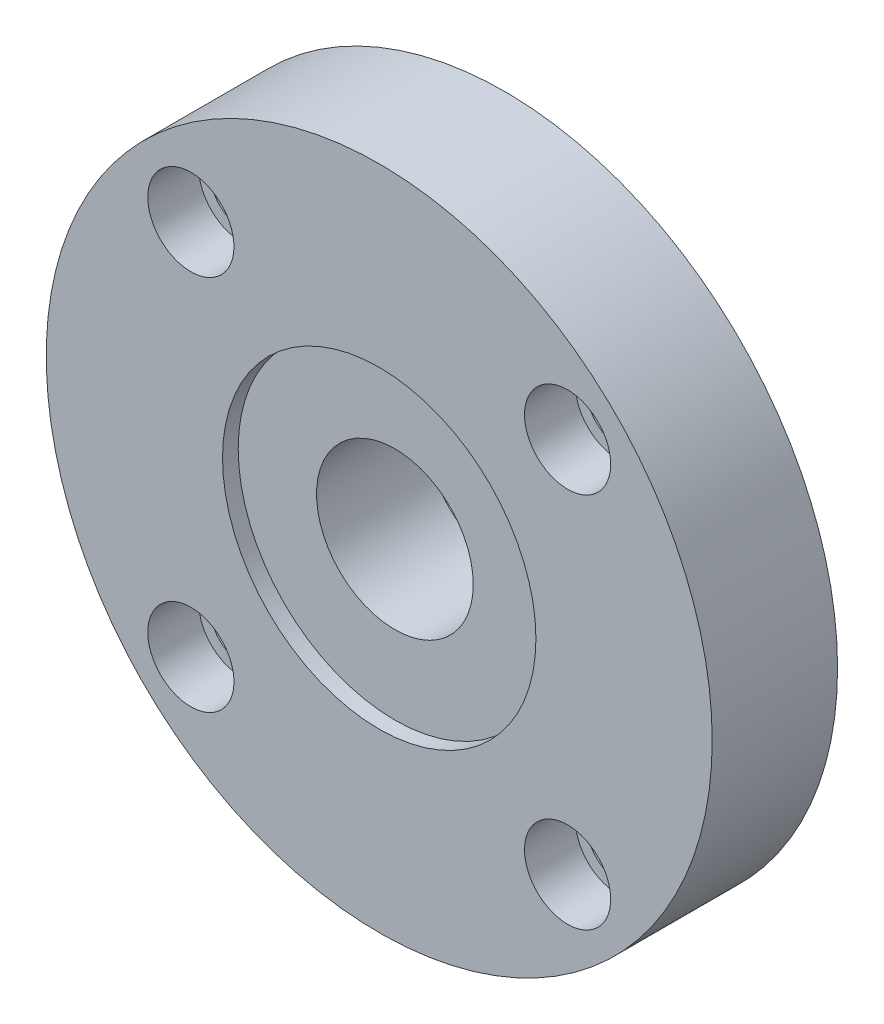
ISO-10303-21;
HEADER;
FILE_DESCRIPTION(('STEP AP214'),'2;1');
FILE_NAME('part.step','',(''),(''),'','','');
FILE_SCHEMA(('AUTOMOTIVE_DESIGN { 1 0 10303 214 1 1 1 1 }'));
ENDSEC;
DATA;
#1=APPLICATION_CONTEXT('core data for automotive mechanical design processes');
#2=APPLICATION_PROTOCOL_DEFINITION('international standard','automotive_design',2000,#1);
#3=PRODUCT_CONTEXT('',#1,'mechanical');
#4=PRODUCT('Part','Part','',(#3));
#5=PRODUCT_RELATED_PRODUCT_CATEGORY('part','',(#4));
#6=PRODUCT_DEFINITION_FORMATION('','',#4);
#7=PRODUCT_DEFINITION_CONTEXT('part definition',#1,'design');
#8=PRODUCT_DEFINITION('design','',#6,#7);
#9=PRODUCT_DEFINITION_SHAPE('','',#8);
#10=(LENGTH_UNIT() NAMED_UNIT(*) SI_UNIT(.MILLI.,.METRE.));
#11=(NAMED_UNIT(*) PLANE_ANGLE_UNIT() SI_UNIT($,.RADIAN.));
#12=(NAMED_UNIT(*) SI_UNIT($,.STERADIAN.) SOLID_ANGLE_UNIT());
#13=UNCERTAINTY_MEASURE_WITH_UNIT(LENGTH_MEASURE(1.E-05),#10,'distance_accuracy_value','');
#14=(GEOMETRIC_REPRESENTATION_CONTEXT(3) GLOBAL_UNCERTAINTY_ASSIGNED_CONTEXT((#13)) GLOBAL_UNIT_ASSIGNED_CONTEXT((#10,
#11,#12)) REPRESENTATION_CONTEXT('',''));
#15=CARTESIAN_POINT('',(0.,0.,0.));
#16=DIRECTION('',(0.,0.,1.));
#17=DIRECTION('',(1.,0.,0.));
#18=AXIS2_PLACEMENT_3D('',#15,#16,#17);
#19=CARTESIAN_POINT('',(0.,0.,16.));
#20=DIRECTION('',(0.,0.,-1.));
#21=DIRECTION('',(-1.,0.,0.));
#22=AXIS2_PLACEMENT_3D('',#19,#20,#21);
#23=CYLINDRICAL_SURFACE('',#22,10.);
#24=CARTESIAN_POINT('',(0.,0.,0.));
#25=DIRECTION('',(0.,0.,1.));
#26=DIRECTION('',(1.,0.,0.));
#27=AXIS2_PLACEMENT_3D('',#24,#25,#26);
#28=CIRCLE('',#27,10.);
#29=CARTESIAN_POINT('',(10.,0.,0.));
#30=VERTEX_POINT('',#29);
#31=EDGE_CURVE('E25',#30,#30,#28,.T.);
#32=ORIENTED_EDGE('',*,*,#31,.F.);
#33=EDGE_LOOP('',(#32));
#34=FACE_BOUND('',#33,.T.);
#35=CARTESIAN_POINT('',(0.,0.,14.));
#36=DIRECTION('',(0.,0.,1.));
#37=DIRECTION('',(1.,0.,0.));
#38=AXIS2_PLACEMENT_3D('',#35,#36,#37);
#39=CIRCLE('',#38,10.);
#40=CARTESIAN_POINT('',(10.,0.,14.));
#41=VERTEX_POINT('',#40);
#42=EDGE_CURVE('E16',#41,#41,#39,.T.);
#43=ORIENTED_EDGE('',*,*,#42,.T.);
#44=EDGE_LOOP('',(#43));
#45=FACE_BOUND('',#44,.T.);
#46=ADVANCED_FACE('F12',(#34,#45),#23,.F.);
#47=CARTESIAN_POINT('',(-24.0416305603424,24.0416305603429,0.));
#48=DIRECTION('',(0.,0.,1.));
#49=DIRECTION('',(1.,0.,0.));
#50=AXIS2_PLACEMENT_3D('',#47,#48,#49);
#51=CYLINDRICAL_SURFACE('',#50,4.);
#52=CARTESIAN_POINT('',(-24.0416305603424,24.0416305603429,0.));
#53=DIRECTION('',(0.,0.,1.));
#54=DIRECTION('',(0.,1.,0.));
#55=AXIS2_PLACEMENT_3D('',#52,#53,#54);
#56=CIRCLE('',#55,4.);
#57=CARTESIAN_POINT('',(-24.0416305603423,28.0416305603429,0.));
#58=VERTEX_POINT('',#57);
#59=EDGE_CURVE('E37',#58,#58,#56,.T.);
#60=ORIENTED_EDGE('',*,*,#59,.F.);
#61=EDGE_LOOP('',(#60));
#62=FACE_BOUND('',#61,.T.);
#63=CARTESIAN_POINT('',(-24.0416305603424,24.0416305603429,9.5));
#64=DIRECTION('',(0.,0.,1.));
#65=DIRECTION('',(1.,0.,0.));
#66=AXIS2_PLACEMENT_3D('',#63,#64,#65);
#67=CIRCLE('',#66,4.);
#68=CARTESIAN_POINT('',(-20.0416305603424,24.0416305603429,9.5));
#69=VERTEX_POINT('',#68);
#70=EDGE_CURVE('E43',#69,#69,#67,.F.);
#71=ORIENTED_EDGE('',*,*,#70,.F.);
#72=EDGE_LOOP('',(#71));
#73=FACE_BOUND('',#72,.T.);
#74=ADVANCED_FACE('F87',(#62,#73),#51,.F.);
#75=CARTESIAN_POINT('',(-24.0416305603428,-24.0416305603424,0.));
#76=DIRECTION('',(0.,0.,1.));
#77=DIRECTION('',(1.,0.,0.));
#78=AXIS2_PLACEMENT_3D('',#75,#76,#77);
#79=CYLINDRICAL_SURFACE('',#78,4.);
#80=CARTESIAN_POINT('',(-24.0416305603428,-24.0416305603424,0.));
#81=DIRECTION('',(0.,0.,1.));
#82=DIRECTION('',(-1.,0.,0.));
#83=AXIS2_PLACEMENT_3D('',#80,#81,#82);
#84=CIRCLE('',#83,4.);
#85=CARTESIAN_POINT('',(-28.0416305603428,-24.0416305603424,0.));
#86=VERTEX_POINT('',#85);
#87=EDGE_CURVE('E68',#86,#86,#84,.T.);
#88=ORIENTED_EDGE('',*,*,#87,.F.);
#89=EDGE_LOOP('',(#88));
#90=FACE_BOUND('',#89,.T.);
#91=CARTESIAN_POINT('',(-24.0416305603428,-24.0416305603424,9.5));
#92=DIRECTION('',(0.,0.,1.));
#93=DIRECTION('',(1.,0.,0.));
#94=AXIS2_PLACEMENT_3D('',#91,#92,#93);
#95=CIRCLE('',#94,4.);
#96=CARTESIAN_POINT('',(-20.0416305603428,-24.0416305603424,9.5));
#97=VERTEX_POINT('',#96);
#98=EDGE_CURVE('E39',#97,#97,#95,.F.);
#99=ORIENTED_EDGE('',*,*,#98,.F.);
#100=EDGE_LOOP('',(#99));
#101=FACE_BOUND('',#100,.T.);
#102=ADVANCED_FACE('F160',(#90,#101),#79,.F.);
#103=CARTESIAN_POINT('',(24.0416305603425,-24.0416305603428,0.));
#104=DIRECTION('',(0.,0.,1.));
#105=DIRECTION('',(1.,0.,0.));
#106=AXIS2_PLACEMENT_3D('',#103,#104,#105);
#107=CYLINDRICAL_SURFACE('',#106,4.);
#108=CARTESIAN_POINT('',(24.0416305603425,-24.0416305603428,0.));
#109=DIRECTION('',(0.,0.,1.));
#110=DIRECTION('',(0.,-1.,0.));
#111=AXIS2_PLACEMENT_3D('',#108,#109,#110);
#112=CIRCLE('',#111,4.);
#113=CARTESIAN_POINT('',(24.0416305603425,-28.0416305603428,0.));
#114=VERTEX_POINT('',#113);
#115=EDGE_CURVE('E71',#114,#114,#112,.T.);
#116=ORIENTED_EDGE('',*,*,#115,.F.);
#117=EDGE_LOOP('',(#116));
#118=FACE_BOUND('',#117,.T.);
#119=CARTESIAN_POINT('',(24.0416305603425,-24.0416305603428,9.5));
#120=DIRECTION('',(0.,0.,1.));
#121=DIRECTION('',(1.,0.,0.));
#122=AXIS2_PLACEMENT_3D('',#119,#120,#121);
#123=CIRCLE('',#122,4.);
#124=CARTESIAN_POINT('',(28.0416305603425,-24.0416305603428,9.5));
#125=VERTEX_POINT('',#124);
#126=EDGE_CURVE('E34',#125,#125,#123,.F.);
#127=ORIENTED_EDGE('',*,*,#126,.F.);
#128=EDGE_LOOP('',(#127));
#129=FACE_BOUND('',#128,.T.);
#130=ADVANCED_FACE('F135',(#118,#129),#107,.F.);
#131=CARTESIAN_POINT('',(24.0416305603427,24.0416305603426,0.));
#132=DIRECTION('',(0.,0.,1.));
#133=DIRECTION('',(1.,0.,0.));
#134=AXIS2_PLACEMENT_3D('',#131,#132,#133);
#135=CYLINDRICAL_SURFACE('',#134,4.);
#136=CARTESIAN_POINT('',(24.0416305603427,24.0416305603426,0.));
#137=DIRECTION('',(0.,0.,1.));
#138=DIRECTION('',(1.,0.,0.));
#139=AXIS2_PLACEMENT_3D('',#136,#137,#138);
#140=CIRCLE('',#139,4.);
#141=CARTESIAN_POINT('',(28.0416305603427,24.0416305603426,0.));
#142=VERTEX_POINT('',#141);
#143=EDGE_CURVE('E32',#142,#142,#140,.T.);
#144=ORIENTED_EDGE('',*,*,#143,.F.);
#145=EDGE_LOOP('',(#144));
#146=FACE_BOUND('',#145,.T.);
#147=CARTESIAN_POINT('',(24.0416305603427,24.0416305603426,9.5));
#148=DIRECTION('',(0.,0.,1.));
#149=DIRECTION('',(1.,0.,0.));
#150=AXIS2_PLACEMENT_3D('',#147,#148,#149);
#151=CIRCLE('',#150,4.);
#152=CARTESIAN_POINT('',(28.0416305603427,24.0416305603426,9.5));
#153=VERTEX_POINT('',#152);
#154=EDGE_CURVE('E29',#153,#153,#151,.F.);
#155=ORIENTED_EDGE('',*,*,#154,.F.);
#156=EDGE_LOOP('',(#155));
#157=FACE_BOUND('',#156,.T.);
#158=ADVANCED_FACE('F106',(#146,#157),#135,.F.);
#159=CARTESIAN_POINT('',(0.,0.,16.));
#160=DIRECTION('',(0.,0.,1.));
#161=DIRECTION('',(1.,0.,0.));
#162=AXIS2_PLACEMENT_3D('',#159,#160,#161);
#163=PLANE('',#162);
#164=CARTESIAN_POINT('',(0.,0.,16.));
#165=DIRECTION('',(0.,0.,1.));
#166=DIRECTION('',(1.,0.,0.));
#167=AXIS2_PLACEMENT_3D('',#164,#165,#166);
#168=CIRCLE('',#167,20.);
#169=CARTESIAN_POINT('',(20.,0.,16.));
#170=VERTEX_POINT('',#169);
#171=EDGE_CURVE('E94',#170,#170,#168,.T.);
#172=ORIENTED_EDGE('',*,*,#171,.F.);
#173=EDGE_LOOP('',(#172));
#174=FACE_BOUND('',#173,.T.);
#175=CARTESIAN_POINT('',(-24.0416305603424,24.0416305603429,16.));
#176=DIRECTION('',(0.,0.,1.));
#177=DIRECTION('',(0.,1.,0.));
#178=AXIS2_PLACEMENT_3D('',#175,#176,#177);
#179=CIRCLE('',#178,5.5);
#180=CARTESIAN_POINT('',(-24.0416305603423,29.5416305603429,16.));
#181=VERTEX_POINT('',#180);
#182=EDGE_CURVE('E52',#181,#181,#179,.T.);
#183=ORIENTED_EDGE('',*,*,#182,.F.);
#184=EDGE_LOOP('',(#183));
#185=FACE_BOUND('',#184,.T.);
#186=CARTESIAN_POINT('',(-24.0416305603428,-24.0416305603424,16.));
#187=DIRECTION('',(0.,0.,1.));
#188=DIRECTION('',(-1.,0.,0.));
#189=AXIS2_PLACEMENT_3D('',#186,#187,#188);
#190=CIRCLE('',#189,5.5);
#191=CARTESIAN_POINT('',(-29.5416305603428,-24.0416305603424,16.));
#192=VERTEX_POINT('',#191);
#193=EDGE_CURVE('E45',#192,#192,#190,.T.);
#194=ORIENTED_EDGE('',*,*,#193,.F.);
#195=EDGE_LOOP('',(#194));
#196=FACE_BOUND('',#195,.T.);
#197=CARTESIAN_POINT('',(24.0416305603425,-24.0416305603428,16.));
#198=DIRECTION('',(0.,0.,1.));
#199=DIRECTION('',(0.,-1.,0.));
#200=AXIS2_PLACEMENT_3D('',#197,#198,#199);
#201=CIRCLE('',#200,5.5);
#202=CARTESIAN_POINT('',(24.0416305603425,-29.5416305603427,16.));
#203=VERTEX_POINT('',#202);
#204=EDGE_CURVE('E41',#203,#203,#201,.T.);
#205=ORIENTED_EDGE('',*,*,#204,.F.);
#206=EDGE_LOOP('',(#205));
#207=FACE_BOUND('',#206,.T.);
#208=CARTESIAN_POINT('',(24.0416305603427,24.0416305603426,16.));
#209=DIRECTION('',(0.,0.,1.));
#210=DIRECTION('',(1.,0.,0.));
#211=AXIS2_PLACEMENT_3D('',#208,#209,#210);
#212=CIRCLE('',#211,5.5);
#213=CARTESIAN_POINT('',(29.5416305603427,24.0416305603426,16.));
#214=VERTEX_POINT('',#213);
#215=EDGE_CURVE('E74',#214,#214,#212,.T.);
#216=ORIENTED_EDGE('',*,*,#215,.F.);
#217=EDGE_LOOP('',(#216));
#218=FACE_BOUND('',#217,.T.);
#219=CARTESIAN_POINT('',(0.,0.,16.));
#220=DIRECTION('',(0.,0.,1.));
#221=DIRECTION('',(1.,0.,0.));
#222=AXIS2_PLACEMENT_3D('',#219,#220,#221);
#223=CIRCLE('',#222,42.5);
#224=CARTESIAN_POINT('',(42.5,0.,16.));
#225=VERTEX_POINT('',#224);
#226=EDGE_CURVE('E8',#225,#225,#223,.T.);
#227=ORIENTED_EDGE('',*,*,#226,.T.);
#228=EDGE_LOOP('',(#227));
#229=FACE_BOUND('',#228,.T.);
#230=ADVANCED_FACE('F103',(#174,#185,#196,#207,#218,#229),#163,.T.);
#231=CARTESIAN_POINT('',(0.,0.,0.));
#232=DIRECTION('',(0.,0.,1.));
#233=DIRECTION('',(1.,0.,0.));
#234=AXIS2_PLACEMENT_3D('',#231,#232,#233);
#235=PLANE('',#234);
#236=ORIENTED_EDGE('',*,*,#59,.T.);
#237=EDGE_LOOP('',(#236));
#238=FACE_BOUND('',#237,.T.);
#239=ORIENTED_EDGE('',*,*,#87,.T.);
#240=EDGE_LOOP('',(#239));
#241=FACE_BOUND('',#240,.T.);
#242=ORIENTED_EDGE('',*,*,#115,.T.);
#243=EDGE_LOOP('',(#242));
#244=FACE_BOUND('',#243,.T.);
#245=ORIENTED_EDGE('',*,*,#143,.T.);
#246=EDGE_LOOP('',(#245));
#247=FACE_BOUND('',#246,.T.);
#248=CARTESIAN_POINT('',(0.,0.,0.));
#249=DIRECTION('',(0.,0.,1.));
#250=DIRECTION('',(1.,0.,0.));
#251=AXIS2_PLACEMENT_3D('',#248,#249,#250);
#252=CIRCLE('',#251,42.5);
#253=CARTESIAN_POINT('',(42.5,0.,0.));
#254=VERTEX_POINT('',#253);
#255=EDGE_CURVE('E20',#254,#254,#252,.T.);
#256=ORIENTED_EDGE('',*,*,#255,.F.);
#257=EDGE_LOOP('',(#256));
#258=FACE_BOUND('',#257,.T.);
#259=ORIENTED_EDGE('',*,*,#31,.T.);
#260=EDGE_LOOP('',(#259));
#261=FACE_BOUND('',#260,.T.);
#262=ADVANCED_FACE('F83',(#238,#241,#244,#247,#258,#261),#235,.F.);
#263=CARTESIAN_POINT('',(0.,0.,16.));
#264=DIRECTION('',(0.,0.,-1.));
#265=DIRECTION('',(-1.,0.,0.));
#266=AXIS2_PLACEMENT_3D('',#263,#264,#265);
#267=CYLINDRICAL_SURFACE('',#266,42.5);
#268=ORIENTED_EDGE('',*,*,#226,.F.);
#269=EDGE_LOOP('',(#268));
#270=FACE_BOUND('',#269,.T.);
#271=ORIENTED_EDGE('',*,*,#255,.T.);
#272=EDGE_LOOP('',(#271));
#273=FACE_BOUND('',#272,.T.);
#274=ADVANCED_FACE('F14',(#270,#273),#267,.T.);
#275=CARTESIAN_POINT('',(24.0416305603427,24.0416305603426,9.5));
#276=DIRECTION('',(0.,0.,1.));
#277=DIRECTION('',(1.,0.,0.));
#278=AXIS2_PLACEMENT_3D('',#275,#276,#277);
#279=PLANE('',#278);
#280=CARTESIAN_POINT('',(24.0416305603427,24.0416305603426,9.5));
#281=DIRECTION('',(0.,0.,1.));
#282=DIRECTION('',(1.,0.,0.));
#283=AXIS2_PLACEMENT_3D('',#280,#281,#282);
#284=CIRCLE('',#283,5.5);
#285=CARTESIAN_POINT('',(29.5416305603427,24.0416305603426,9.5));
#286=VERTEX_POINT('',#285);
#287=EDGE_CURVE('E33',#286,#286,#284,.T.);
#288=ORIENTED_EDGE('',*,*,#287,.T.);
#289=EDGE_LOOP('',(#288));
#290=FACE_BOUND('',#289,.T.);
#291=ORIENTED_EDGE('',*,*,#154,.T.);
#292=EDGE_LOOP('',(#291));
#293=FACE_BOUND('',#292,.T.);
#294=ADVANCED_FACE('F118',(#290,#293),#279,.T.);
#295=CARTESIAN_POINT('',(24.0416305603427,24.0416305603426,9.5));
#296=DIRECTION('',(0.,0.,1.));
#297=DIRECTION('',(1.,0.,0.));
#298=AXIS2_PLACEMENT_3D('',#295,#296,#297);
#299=CYLINDRICAL_SURFACE('',#298,5.5);
#300=ORIENTED_EDGE('',*,*,#287,.F.);
#301=EDGE_LOOP('',(#300));
#302=FACE_BOUND('',#301,.T.);
#303=ORIENTED_EDGE('',*,*,#215,.T.);
#304=EDGE_LOOP('',(#303));
#305=FACE_BOUND('',#304,.T.);
#306=ADVANCED_FACE('F115',(#302,#305),#299,.F.);
#307=CARTESIAN_POINT('',(24.0416305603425,-24.0416305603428,9.5));
#308=DIRECTION('',(0.,0.,1.));
#309=DIRECTION('',(0.,-1.,0.));
#310=AXIS2_PLACEMENT_3D('',#307,#308,#309);
#311=PLANE('',#310);
#312=CARTESIAN_POINT('',(24.0416305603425,-24.0416305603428,9.5));
#313=DIRECTION('',(0.,0.,1.));
#314=DIRECTION('',(0.,-1.,0.));
#315=AXIS2_PLACEMENT_3D('',#312,#313,#314);
#316=CIRCLE('',#315,5.5);
#317=CARTESIAN_POINT('',(24.0416305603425,-29.5416305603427,9.5));
#318=VERTEX_POINT('',#317);
#319=EDGE_CURVE('E38',#318,#318,#316,.T.);
#320=ORIENTED_EDGE('',*,*,#319,.T.);
#321=EDGE_LOOP('',(#320));
#322=FACE_BOUND('',#321,.T.);
#323=ORIENTED_EDGE('',*,*,#126,.T.);
#324=EDGE_LOOP('',(#323));
#325=FACE_BOUND('',#324,.T.);
#326=ADVANCED_FACE('F117',(#322,#325),#311,.T.);
#327=CARTESIAN_POINT('',(24.0416305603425,-24.0416305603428,9.5));
#328=DIRECTION('',(0.,0.,1.));
#329=DIRECTION('',(1.,0.,0.));
#330=AXIS2_PLACEMENT_3D('',#327,#328,#329);
#331=CYLINDRICAL_SURFACE('',#330,5.5);
#332=ORIENTED_EDGE('',*,*,#319,.F.);
#333=EDGE_LOOP('',(#332));
#334=FACE_BOUND('',#333,.T.);
#335=ORIENTED_EDGE('',*,*,#204,.T.);
#336=EDGE_LOOP('',(#335));
#337=FACE_BOUND('',#336,.T.);
#338=ADVANCED_FACE('F126',(#334,#337),#331,.F.);
#339=CARTESIAN_POINT('',(-24.0416305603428,-24.0416305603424,9.5));
#340=DIRECTION('',(0.,0.,1.));
#341=DIRECTION('',(-1.,0.,0.));
#342=AXIS2_PLACEMENT_3D('',#339,#340,#341);
#343=PLANE('',#342);
#344=CARTESIAN_POINT('',(-24.0416305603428,-24.0416305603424,9.5));
#345=DIRECTION('',(0.,0.,1.));
#346=DIRECTION('',(-1.,0.,0.));
#347=AXIS2_PLACEMENT_3D('',#344,#345,#346);
#348=CIRCLE('',#347,5.5);
#349=CARTESIAN_POINT('',(-29.5416305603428,-24.0416305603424,9.5));
#350=VERTEX_POINT('',#349);
#351=EDGE_CURVE('E42',#350,#350,#348,.T.);
#352=ORIENTED_EDGE('',*,*,#351,.T.);
#353=EDGE_LOOP('',(#352));
#354=FACE_BOUND('',#353,.T.);
#355=ORIENTED_EDGE('',*,*,#98,.T.);
#356=EDGE_LOOP('',(#355));
#357=FACE_BOUND('',#356,.T.);
#358=ADVANCED_FACE('F173',(#354,#357),#343,.T.);
#359=CARTESIAN_POINT('',(-24.0416305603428,-24.0416305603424,9.5));
#360=DIRECTION('',(0.,0.,1.));
#361=DIRECTION('',(1.,0.,0.));
#362=AXIS2_PLACEMENT_3D('',#359,#360,#361);
#363=CYLINDRICAL_SURFACE('',#362,5.5);
#364=ORIENTED_EDGE('',*,*,#351,.F.);
#365=EDGE_LOOP('',(#364));
#366=FACE_BOUND('',#365,.T.);
#367=ORIENTED_EDGE('',*,*,#193,.T.);
#368=EDGE_LOOP('',(#367));
#369=FACE_BOUND('',#368,.T.);
#370=ADVANCED_FACE('F176',(#366,#369),#363,.F.);
#371=CARTESIAN_POINT('',(-24.0416305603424,24.0416305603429,9.5));
#372=DIRECTION('',(0.,0.,1.));
#373=DIRECTION('',(0.,1.,0.));
#374=AXIS2_PLACEMENT_3D('',#371,#372,#373);
#375=PLANE('',#374);
#376=CARTESIAN_POINT('',(-24.0416305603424,24.0416305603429,9.5));
#377=DIRECTION('',(0.,0.,1.));
#378=DIRECTION('',(0.,1.,0.));
#379=AXIS2_PLACEMENT_3D('',#376,#377,#378);
#380=CIRCLE('',#379,5.5);
#381=CARTESIAN_POINT('',(-24.0416305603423,29.5416305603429,9.5));
#382=VERTEX_POINT('',#381);
#383=EDGE_CURVE('E46',#382,#382,#380,.T.);
#384=ORIENTED_EDGE('',*,*,#383,.T.);
#385=EDGE_LOOP('',(#384));
#386=FACE_BOUND('',#385,.T.);
#387=ORIENTED_EDGE('',*,*,#70,.T.);
#388=EDGE_LOOP('',(#387));
#389=FACE_BOUND('',#388,.T.);
#390=ADVANCED_FACE('F179',(#386,#389),#375,.T.);
#391=CARTESIAN_POINT('',(-24.0416305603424,24.0416305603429,9.5));
#392=DIRECTION('',(0.,0.,1.));
#393=DIRECTION('',(1.,0.,0.));
#394=AXIS2_PLACEMENT_3D('',#391,#392,#393);
#395=CYLINDRICAL_SURFACE('',#394,5.5);
#396=ORIENTED_EDGE('',*,*,#383,.F.);
#397=EDGE_LOOP('',(#396));
#398=FACE_BOUND('',#397,.T.);
#399=ORIENTED_EDGE('',*,*,#182,.T.);
#400=EDGE_LOOP('',(#399));
#401=FACE_BOUND('',#400,.T.);
#402=ADVANCED_FACE('F184',(#398,#401),#395,.F.);
#403=CARTESIAN_POINT('',(0.,0.,14.));
#404=DIRECTION('',(0.,0.,1.));
#405=DIRECTION('',(1.,0.,0.));
#406=AXIS2_PLACEMENT_3D('',#403,#404,#405);
#407=CYLINDRICAL_SURFACE('',#406,20.);
#408=CARTESIAN_POINT('',(0.,0.,14.));
#409=DIRECTION('',(0.,0.,1.));
#410=DIRECTION('',(1.,0.,0.));
#411=AXIS2_PLACEMENT_3D('',#408,#409,#410);
#412=CIRCLE('',#411,20.);
#413=CARTESIAN_POINT('',(20.,0.,14.));
#414=VERTEX_POINT('',#413);
#415=EDGE_CURVE('E92',#414,#414,#412,.T.);
#416=ORIENTED_EDGE('',*,*,#415,.F.);
#417=EDGE_LOOP('',(#416));
#418=FACE_BOUND('',#417,.T.);
#419=ORIENTED_EDGE('',*,*,#171,.T.);
#420=EDGE_LOOP('',(#419));
#421=FACE_BOUND('',#420,.T.);
#422=ADVANCED_FACE('F101',(#418,#421),#407,.F.);
#423=CARTESIAN_POINT('',(0.,0.,14.));
#424=DIRECTION('',(0.,0.,1.));
#425=DIRECTION('',(1.,0.,0.));
#426=AXIS2_PLACEMENT_3D('',#423,#424,#425);
#427=PLANE('',#426);
#428=ORIENTED_EDGE('',*,*,#42,.F.);
#429=EDGE_LOOP('',(#428));
#430=FACE_BOUND('',#429,.T.);
#431=ORIENTED_EDGE('',*,*,#415,.T.);
#432=EDGE_LOOP('',(#431));
#433=FACE_BOUND('',#432,.T.);
#434=ADVANCED_FACE('F188',(#430,#433),#427,.T.);
#435=CLOSED_SHELL('',(#46,#74,#102,#130,#158,#230,#262,#274,#294,#306,#326,#338,#358,#370,#390,
#402,#422,#434));
#436=MANIFOLD_SOLID_BREP('B1',#435);
#437=ADVANCED_BREP_SHAPE_REPRESENTATION('',(#18,#436),#14);
#438=SHAPE_DEFINITION_REPRESENTATION(#9,#437);
ENDSEC;
END-ISO-10303-21;
